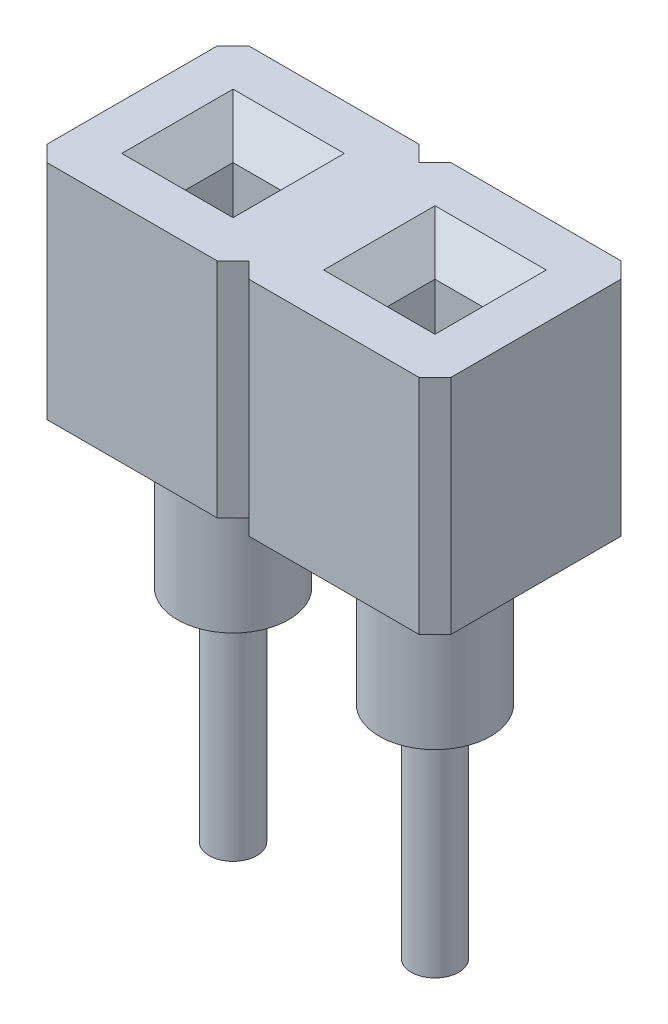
ISO-10303-21;
HEADER;
FILE_DESCRIPTION(('STEP AP214'),'2;1');
FILE_NAME('part.step','',(''),(''),'','','');
FILE_SCHEMA(('AUTOMOTIVE_DESIGN { 1 0 10303 214 1 1 1 1 }'));
ENDSEC;
DATA;
#1=APPLICATION_CONTEXT('core data for automotive mechanical design processes');
#2=APPLICATION_PROTOCOL_DEFINITION('international standard','automotive_design',2000,#1);
#3=PRODUCT_CONTEXT('',#1,'mechanical');
#4=PRODUCT('Part','Part','',(#3));
#5=PRODUCT_RELATED_PRODUCT_CATEGORY('part','',(#4));
#6=PRODUCT_DEFINITION_FORMATION('','',#4);
#7=PRODUCT_DEFINITION_CONTEXT('part definition',#1,'design');
#8=PRODUCT_DEFINITION('design','',#6,#7);
#9=PRODUCT_DEFINITION_SHAPE('','',#8);
#10=(LENGTH_UNIT() NAMED_UNIT(*) SI_UNIT(.MILLI.,.METRE.));
#11=(NAMED_UNIT(*) PLANE_ANGLE_UNIT() SI_UNIT($,.RADIAN.));
#12=(NAMED_UNIT(*) SI_UNIT($,.STERADIAN.) SOLID_ANGLE_UNIT());
#13=UNCERTAINTY_MEASURE_WITH_UNIT(LENGTH_MEASURE(1.E-05),#10,'distance_accuracy_value','');
#14=(GEOMETRIC_REPRESENTATION_CONTEXT(3) GLOBAL_UNCERTAINTY_ASSIGNED_CONTEXT((#13)) GLOBAL_UNIT_ASSIGNED_CONTEXT((#10,
#11,#12)) REPRESENTATION_CONTEXT('',''));
#15=CARTESIAN_POINT('',(0.,0.,0.));
#16=DIRECTION('',(0.,0.,1.));
#17=DIRECTION('',(1.,0.,0.));
#18=AXIS2_PLACEMENT_3D('',#15,#16,#17);
#19=CARTESIAN_POINT('',(2.34,0.,0.));
#20=DIRECTION('',(0.,-1.,0.));
#21=DIRECTION('',(0.,0.,-1.));
#22=AXIS2_PLACEMENT_3D('',#19,#20,#21);
#23=PLANE('',#22);
#24=CARTESIAN_POINT('',(0.,0.,0.));
#25=DIRECTION('',(0.,1.,0.));
#26=DIRECTION('',(-1.,0.,0.));
#27=AXIS2_PLACEMENT_3D('',#24,#25,#26);
#28=CIRCLE('',#27,0.7);
#29=CARTESIAN_POINT('',(-0.7,0.,0.));
#30=VERTEX_POINT('',#29);
#31=EDGE_CURVE('E293',#30,#30,#28,.T.);
#32=ORIENTED_EDGE('',*,*,#31,.T.);
#33=EDGE_LOOP('',(#32));
#34=FACE_BOUND('',#33,.T.);
#35=DIRECTION('',(-0.707106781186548,0.,-0.707106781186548));
#36=VECTOR('',#35,1.);
#37=CARTESIAN_POINT('',(1.07,0.,-1.27));
#38=LINE('',#37,#36);
#39=CARTESIAN_POINT('',(1.27,0.,-1.07));
#40=VERTEX_POINT('',#39);
#41=CARTESIAN_POINT('',(1.07,0.,-1.27));
#42=VERTEX_POINT('',#41);
#43=EDGE_CURVE('E316',#40,#42,#38,.T.);
#44=ORIENTED_EDGE('',*,*,#43,.F.);
#45=DIRECTION('',(0.,0.,-1.));
#46=VECTOR('',#45,1.);
#47=CARTESIAN_POINT('',(1.27,0.,-1.07));
#48=LINE('',#47,#46);
#49=CARTESIAN_POINT('',(1.27,0.,1.07));
#50=VERTEX_POINT('',#49);
#51=EDGE_CURVE('E329',#50,#40,#48,.T.);
#52=ORIENTED_EDGE('',*,*,#51,.F.);
#53=DIRECTION('',(0.707106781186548,0.,-0.707106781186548));
#54=VECTOR('',#53,1.);
#55=CARTESIAN_POINT('',(1.27,0.,1.07));
#56=LINE('',#55,#54);
#57=CARTESIAN_POINT('',(1.07,0.,1.27));
#58=VERTEX_POINT('',#57);
#59=EDGE_CURVE('E327',#58,#50,#56,.T.);
#60=ORIENTED_EDGE('',*,*,#59,.F.);
#61=DIRECTION('',(1.,0.,0.));
#62=VECTOR('',#61,1.);
#63=CARTESIAN_POINT('',(-1.07,0.,1.27));
#64=LINE('',#63,#62);
#65=CARTESIAN_POINT('',(-1.07,0.,1.27));
#66=VERTEX_POINT('',#65);
#67=EDGE_CURVE('E325',#66,#58,#64,.T.);
#68=ORIENTED_EDGE('',*,*,#67,.F.);
#69=DIRECTION('',(0.707106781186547,0.,0.707106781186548));
#70=VECTOR('',#69,1.);
#71=CARTESIAN_POINT('',(-1.27,0.,1.07));
#72=LINE('',#71,#70);
#73=CARTESIAN_POINT('',(-1.27,0.,1.07));
#74=VERTEX_POINT('',#73);
#75=EDGE_CURVE('E323',#74,#66,#72,.T.);
#76=ORIENTED_EDGE('',*,*,#75,.F.);
#77=DIRECTION('',(0.707106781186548,0.,-0.707106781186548));
#78=VECTOR('',#77,1.);
#79=CARTESIAN_POINT('',(-1.27,0.,1.07));
#80=LINE('',#79,#78);
#81=CARTESIAN_POINT('',(-1.47,0.,1.27));
#82=VERTEX_POINT('',#81);
#83=EDGE_CURVE('E237',#82,#74,#80,.T.);
#84=ORIENTED_EDGE('',*,*,#83,.F.);
#85=DIRECTION('',(1.,0.,0.));
#86=VECTOR('',#85,1.);
#87=CARTESIAN_POINT('',(-3.61,0.,1.27));
#88=LINE('',#87,#86);
#89=CARTESIAN_POINT('',(-3.61,0.,1.27));
#90=VERTEX_POINT('',#89);
#91=EDGE_CURVE('E235',#90,#82,#88,.T.);
#92=ORIENTED_EDGE('',*,*,#91,.F.);
#93=DIRECTION('',(0.707106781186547,0.,0.707106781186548));
#94=VECTOR('',#93,1.);
#95=CARTESIAN_POINT('',(-3.81,0.,1.07));
#96=LINE('',#95,#94);
#97=CARTESIAN_POINT('',(-3.81,0.,1.07));
#98=VERTEX_POINT('',#97);
#99=EDGE_CURVE('E233',#98,#90,#96,.T.);
#100=ORIENTED_EDGE('',*,*,#99,.F.);
#101=DIRECTION('',(0.,0.,1.));
#102=VECTOR('',#101,1.);
#103=CARTESIAN_POINT('',(-3.81,0.,-1.07));
#104=LINE('',#103,#102);
#105=CARTESIAN_POINT('',(-3.81,0.,-1.07));
#106=VERTEX_POINT('',#105);
#107=EDGE_CURVE('E231',#106,#98,#104,.T.);
#108=ORIENTED_EDGE('',*,*,#107,.F.);
#109=DIRECTION('',(-0.707106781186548,0.,0.707106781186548));
#110=VECTOR('',#109,1.);
#111=CARTESIAN_POINT('',(-3.61,0.,-1.27));
#112=LINE('',#111,#110);
#113=CARTESIAN_POINT('',(-3.61,0.,-1.27));
#114=VERTEX_POINT('',#113);
#115=EDGE_CURVE('E229',#114,#106,#112,.T.);
#116=ORIENTED_EDGE('',*,*,#115,.F.);
#117=DIRECTION('',(-1.,0.,0.));
#118=VECTOR('',#117,1.);
#119=CARTESIAN_POINT('',(-3.61,0.,-1.27));
#120=LINE('',#119,#118);
#121=CARTESIAN_POINT('',(-1.47,0.,-1.27));
#122=VERTEX_POINT('',#121);
#123=EDGE_CURVE('E227',#122,#114,#120,.T.);
#124=ORIENTED_EDGE('',*,*,#123,.F.);
#125=DIRECTION('',(-0.707106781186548,0.,-0.707106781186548));
#126=VECTOR('',#125,1.);
#127=CARTESIAN_POINT('',(-1.47,0.,-1.27));
#128=LINE('',#127,#126);
#129=CARTESIAN_POINT('',(-1.27,0.,-1.07));
#130=VERTEX_POINT('',#129);
#131=EDGE_CURVE('E224',#130,#122,#128,.T.);
#132=ORIENTED_EDGE('',*,*,#131,.F.);
#133=DIRECTION('',(-0.707106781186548,0.,0.707106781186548));
#134=VECTOR('',#133,1.);
#135=CARTESIAN_POINT('',(-1.07,0.,-1.27));
#136=LINE('',#135,#134);
#137=CARTESIAN_POINT('',(-1.07,0.,-1.27));
#138=VERTEX_POINT('',#137);
#139=EDGE_CURVE('E321',#138,#130,#136,.T.);
#140=ORIENTED_EDGE('',*,*,#139,.F.);
#141=DIRECTION('',(-1.,0.,0.));
#142=VECTOR('',#141,1.);
#143=CARTESIAN_POINT('',(-1.07,0.,-1.27));
#144=LINE('',#143,#142);
#145=EDGE_CURVE('E319',#42,#138,#144,.T.);
#146=ORIENTED_EDGE('',*,*,#145,.F.);
#147=EDGE_LOOP('',(#44,#52,#60,#68,#76,#84,#92,#100,#108,#116,#124,#132,#140,#146));
#148=FACE_BOUND('',#147,.T.);
#149=CARTESIAN_POINT('',(-2.54,0.,0.));
#150=DIRECTION('',(0.,1.,0.));
#151=DIRECTION('',(-1.,0.,0.));
#152=AXIS2_PLACEMENT_3D('',#149,#150,#151);
#153=CIRCLE('',#152,0.7);
#154=CARTESIAN_POINT('',(-3.24,0.,0.));
#155=VERTEX_POINT('',#154);
#156=EDGE_CURVE('E211',#155,#155,#153,.T.);
#157=ORIENTED_EDGE('',*,*,#156,.T.);
#158=EDGE_LOOP('',(#157));
#159=FACE_BOUND('',#158,.T.);
#160=ADVANCED_FACE('F26',(#34,#148,#159),#23,.T.);
#161=CARTESIAN_POINT('',(2.34,2.8,0.));
#162=DIRECTION('',(0.,-1.,0.));
#163=DIRECTION('',(0.,0.,-1.));
#164=AXIS2_PLACEMENT_3D('',#161,#162,#163);
#165=PLANE('',#164);
#166=DIRECTION('',(1.,0.,0.));
#167=VECTOR('',#166,1.);
#168=CARTESIAN_POINT('',(-2.24,2.8,-0.700000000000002));
#169=LINE('',#168,#167);
#170=CARTESIAN_POINT('',(-3.24,2.8,-0.700000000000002));
#171=VERTEX_POINT('',#170);
#172=CARTESIAN_POINT('',(-1.84,2.8,-0.700000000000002));
#173=VERTEX_POINT('',#172);
#174=EDGE_CURVE('E390',#171,#173,#169,.T.);
#175=ORIENTED_EDGE('',*,*,#174,.T.);
#176=DIRECTION('',(0.,0.,1.));
#177=VECTOR('',#176,1.);
#178=CARTESIAN_POINT('',(-1.84,2.8,0.3));
#179=LINE('',#178,#177);
#180=CARTESIAN_POINT('',(-1.84,2.8,0.700000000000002));
#181=VERTEX_POINT('',#180);
#182=EDGE_CURVE('E396',#173,#181,#179,.T.);
#183=ORIENTED_EDGE('',*,*,#182,.T.);
#184=DIRECTION('',(-1.,0.,0.));
#185=VECTOR('',#184,1.);
#186=CARTESIAN_POINT('',(-2.84,2.8,0.700000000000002));
#187=LINE('',#186,#185);
#188=CARTESIAN_POINT('',(-3.24,2.8,0.700000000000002));
#189=VERTEX_POINT('',#188);
#190=EDGE_CURVE('E394',#181,#189,#187,.T.);
#191=ORIENTED_EDGE('',*,*,#190,.T.);
#192=DIRECTION('',(0.,0.,-1.));
#193=VECTOR('',#192,1.);
#194=CARTESIAN_POINT('',(-3.24,2.8,-0.3));
#195=LINE('',#194,#193);
#196=EDGE_CURVE('E392',#189,#171,#195,.T.);
#197=ORIENTED_EDGE('',*,*,#196,.T.);
#198=EDGE_LOOP('',(#175,#183,#191,#197));
#199=FACE_BOUND('',#198,.T.);
#200=DIRECTION('',(1.,0.,0.));
#201=VECTOR('',#200,1.);
#202=CARTESIAN_POINT('',(0.299999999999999,2.8,-0.700000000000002));
#203=LINE('',#202,#201);
#204=CARTESIAN_POINT('',(-0.700000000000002,2.8,-0.700000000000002));
#205=VERTEX_POINT('',#204);
#206=CARTESIAN_POINT('',(0.700000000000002,2.8,-0.700000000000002));
#207=VERTEX_POINT('',#206);
#208=EDGE_CURVE('E372',#205,#207,#203,.T.);
#209=ORIENTED_EDGE('',*,*,#208,.T.);
#210=DIRECTION('',(0.,0.,1.));
#211=VECTOR('',#210,1.);
#212=CARTESIAN_POINT('',(0.700000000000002,2.8,0.3));
#213=LINE('',#212,#211);
#214=CARTESIAN_POINT('',(0.700000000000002,2.8,0.700000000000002));
#215=VERTEX_POINT('',#214);
#216=EDGE_CURVE('E378',#207,#215,#213,.T.);
#217=ORIENTED_EDGE('',*,*,#216,.T.);
#218=DIRECTION('',(-1.,0.,0.));
#219=VECTOR('',#218,1.);
#220=CARTESIAN_POINT('',(-0.3,2.8,0.700000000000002));
#221=LINE('',#220,#219);
#222=CARTESIAN_POINT('',(-0.700000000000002,2.8,0.700000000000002));
#223=VERTEX_POINT('',#222);
#224=EDGE_CURVE('E376',#215,#223,#221,.T.);
#225=ORIENTED_EDGE('',*,*,#224,.T.);
#226=DIRECTION('',(0.,0.,-1.));
#227=VECTOR('',#226,1.);
#228=CARTESIAN_POINT('',(-0.700000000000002,2.8,-0.3));
#229=LINE('',#228,#227);
#230=EDGE_CURVE('E374',#223,#205,#229,.T.);
#231=ORIENTED_EDGE('',*,*,#230,.T.);
#232=EDGE_LOOP('',(#209,#217,#225,#231));
#233=FACE_BOUND('',#232,.T.);
#234=DIRECTION('',(-0.707106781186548,0.,-0.707106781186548));
#235=VECTOR('',#234,1.);
#236=CARTESIAN_POINT('',(1.07,2.8,-1.27));
#237=LINE('',#236,#235);
#238=CARTESIAN_POINT('',(1.27,2.8,-1.07));
#239=VERTEX_POINT('',#238);
#240=CARTESIAN_POINT('',(1.07,2.8,-1.27));
#241=VERTEX_POINT('',#240);
#242=EDGE_CURVE('E331',#239,#241,#237,.T.);
#243=ORIENTED_EDGE('',*,*,#242,.T.);
#244=DIRECTION('',(-1.,0.,0.));
#245=VECTOR('',#244,1.);
#246=CARTESIAN_POINT('',(-1.07,2.8,-1.27));
#247=LINE('',#246,#245);
#248=CARTESIAN_POINT('',(-1.07,2.8,-1.27));
#249=VERTEX_POINT('',#248);
#250=EDGE_CURVE('E334',#241,#249,#247,.T.);
#251=ORIENTED_EDGE('',*,*,#250,.T.);
#252=DIRECTION('',(-0.707106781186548,0.,0.707106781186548));
#253=VECTOR('',#252,1.);
#254=CARTESIAN_POINT('',(-1.07,2.8,-1.27));
#255=LINE('',#254,#253);
#256=CARTESIAN_POINT('',(-1.27,2.8,-1.07));
#257=VERTEX_POINT('',#256);
#258=EDGE_CURVE('E336',#249,#257,#255,.T.);
#259=ORIENTED_EDGE('',*,*,#258,.T.);
#260=DIRECTION('',(-0.707106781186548,0.,-0.707106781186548));
#261=VECTOR('',#260,1.);
#262=CARTESIAN_POINT('',(-1.47,2.8,-1.27));
#263=LINE('',#262,#261);
#264=CARTESIAN_POINT('',(-1.47,2.8,-1.27));
#265=VERTEX_POINT('',#264);
#266=EDGE_CURVE('E240',#257,#265,#263,.T.);
#267=ORIENTED_EDGE('',*,*,#266,.T.);
#268=DIRECTION('',(-1.,0.,0.));
#269=VECTOR('',#268,1.);
#270=CARTESIAN_POINT('',(-3.61,2.8,-1.27));
#271=LINE('',#270,#269);
#272=CARTESIAN_POINT('',(-3.61,2.8,-1.27));
#273=VERTEX_POINT('',#272);
#274=EDGE_CURVE('E243',#265,#273,#271,.T.);
#275=ORIENTED_EDGE('',*,*,#274,.T.);
#276=DIRECTION('',(-0.707106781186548,0.,0.707106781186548));
#277=VECTOR('',#276,1.);
#278=CARTESIAN_POINT('',(-3.61,2.8,-1.27));
#279=LINE('',#278,#277);
#280=CARTESIAN_POINT('',(-3.81,2.8,-1.07));
#281=VERTEX_POINT('',#280);
#282=EDGE_CURVE('E245',#273,#281,#279,.T.);
#283=ORIENTED_EDGE('',*,*,#282,.T.);
#284=DIRECTION('',(0.,0.,1.));
#285=VECTOR('',#284,1.);
#286=CARTESIAN_POINT('',(-3.81,2.8,-1.07));
#287=LINE('',#286,#285);
#288=CARTESIAN_POINT('',(-3.81,2.8,1.07));
#289=VERTEX_POINT('',#288);
#290=EDGE_CURVE('E247',#281,#289,#287,.T.);
#291=ORIENTED_EDGE('',*,*,#290,.T.);
#292=DIRECTION('',(0.707106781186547,0.,0.707106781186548));
#293=VECTOR('',#292,1.);
#294=CARTESIAN_POINT('',(-3.81,2.8,1.07));
#295=LINE('',#294,#293);
#296=CARTESIAN_POINT('',(-3.61,2.8,1.27));
#297=VERTEX_POINT('',#296);
#298=EDGE_CURVE('E249',#289,#297,#295,.T.);
#299=ORIENTED_EDGE('',*,*,#298,.T.);
#300=DIRECTION('',(1.,0.,0.));
#301=VECTOR('',#300,1.);
#302=CARTESIAN_POINT('',(-3.61,2.8,1.27));
#303=LINE('',#302,#301);
#304=CARTESIAN_POINT('',(-1.47,2.8,1.27));
#305=VERTEX_POINT('',#304);
#306=EDGE_CURVE('E251',#297,#305,#303,.T.);
#307=ORIENTED_EDGE('',*,*,#306,.T.);
#308=DIRECTION('',(0.707106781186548,0.,-0.707106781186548));
#309=VECTOR('',#308,1.);
#310=CARTESIAN_POINT('',(-1.27,2.8,1.07));
#311=LINE('',#310,#309);
#312=CARTESIAN_POINT('',(-1.27,2.8,1.07));
#313=VERTEX_POINT('',#312);
#314=EDGE_CURVE('E253',#305,#313,#311,.T.);
#315=ORIENTED_EDGE('',*,*,#314,.T.);
#316=DIRECTION('',(0.707106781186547,0.,0.707106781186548));
#317=VECTOR('',#316,1.);
#318=CARTESIAN_POINT('',(-1.27,2.8,1.07));
#319=LINE('',#318,#317);
#320=CARTESIAN_POINT('',(-1.07,2.8,1.27));
#321=VERTEX_POINT('',#320);
#322=EDGE_CURVE('E338',#313,#321,#319,.T.);
#323=ORIENTED_EDGE('',*,*,#322,.T.);
#324=DIRECTION('',(1.,0.,0.));
#325=VECTOR('',#324,1.);
#326=CARTESIAN_POINT('',(-1.07,2.8,1.27));
#327=LINE('',#326,#325);
#328=CARTESIAN_POINT('',(1.07,2.8,1.27));
#329=VERTEX_POINT('',#328);
#330=EDGE_CURVE('E340',#321,#329,#327,.T.);
#331=ORIENTED_EDGE('',*,*,#330,.T.);
#332=DIRECTION('',(0.707106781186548,0.,-0.707106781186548));
#333=VECTOR('',#332,1.);
#334=CARTESIAN_POINT('',(1.27,2.8,1.07));
#335=LINE('',#334,#333);
#336=CARTESIAN_POINT('',(1.27,2.8,1.07));
#337=VERTEX_POINT('',#336);
#338=EDGE_CURVE('E342',#329,#337,#335,.T.);
#339=ORIENTED_EDGE('',*,*,#338,.T.);
#340=DIRECTION('',(0.,0.,-1.));
#341=VECTOR('',#340,1.);
#342=CARTESIAN_POINT('',(1.27,2.8,-1.07));
#343=LINE('',#342,#341);
#344=EDGE_CURVE('E344',#337,#239,#343,.T.);
#345=ORIENTED_EDGE('',*,*,#344,.T.);
#346=EDGE_LOOP('',(#243,#251,#259,#267,#275,#283,#291,#299,#307,#315,#323,#331,#339,#345));
#347=FACE_BOUND('',#346,.T.);
#348=ADVANCED_FACE('F473',(#199,#233,#347),#165,.F.);
#349=CARTESIAN_POINT('',(1.07,2.8,-1.27));
#350=DIRECTION('',(-0.707106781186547,0.,0.707106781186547));
#351=DIRECTION('',(0.707106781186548,0.,0.707106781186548));
#352=AXIS2_PLACEMENT_3D('',#349,#350,#351);
#353=PLANE('',#352);
#354=ORIENTED_EDGE('',*,*,#43,.T.);
#355=DIRECTION('',(0.,-1.,0.));
#356=VECTOR('',#355,1.);
#357=CARTESIAN_POINT('',(1.07,2.8,-1.27));
#358=LINE('',#357,#356);
#359=EDGE_CURVE('E366',#241,#42,#358,.T.);
#360=ORIENTED_EDGE('',*,*,#359,.F.);
#361=ORIENTED_EDGE('',*,*,#242,.F.);
#362=DIRECTION('',(0.,-1.,0.));
#363=VECTOR('',#362,1.);
#364=CARTESIAN_POINT('',(1.27,2.8,-1.07));
#365=LINE('',#364,#363);
#366=EDGE_CURVE('E346',#239,#40,#365,.T.);
#367=ORIENTED_EDGE('',*,*,#366,.T.);
#368=EDGE_LOOP('',(#354,#360,#361,#367));
#369=FACE_BOUND('',#368,.T.);
#370=ADVANCED_FACE('F28',(#369),#353,.F.);
#371=CARTESIAN_POINT('',(-1.07,2.8,-1.27));
#372=DIRECTION('',(0.,0.,1.));
#373=DIRECTION('',(1.,0.,0.));
#374=AXIS2_PLACEMENT_3D('',#371,#372,#373);
#375=PLANE('',#374);
#376=ORIENTED_EDGE('',*,*,#145,.T.);
#377=DIRECTION('',(0.,-1.,0.));
#378=VECTOR('',#377,1.);
#379=CARTESIAN_POINT('',(-1.07,2.8,-1.27));
#380=LINE('',#379,#378);
#381=EDGE_CURVE('E363',#249,#138,#380,.T.);
#382=ORIENTED_EDGE('',*,*,#381,.F.);
#383=ORIENTED_EDGE('',*,*,#250,.F.);
#384=ORIENTED_EDGE('',*,*,#359,.T.);
#385=EDGE_LOOP('',(#376,#382,#383,#384));
#386=FACE_BOUND('',#385,.T.);
#387=ADVANCED_FACE('F505',(#386),#375,.F.);
#388=CARTESIAN_POINT('',(-1.07,2.8,-1.27));
#389=DIRECTION('',(0.707106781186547,0.,0.707106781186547));
#390=DIRECTION('',(0.707106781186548,0.,-0.707106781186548));
#391=AXIS2_PLACEMENT_3D('',#388,#389,#390);
#392=PLANE('',#391);
#393=ORIENTED_EDGE('',*,*,#139,.T.);
#394=DIRECTION('',(0.,-1.,0.));
#395=VECTOR('',#394,1.);
#396=CARTESIAN_POINT('',(-1.27,2.8,-1.07));
#397=LINE('',#396,#395);
#398=EDGE_CURVE('E360',#257,#130,#397,.T.);
#399=ORIENTED_EDGE('',*,*,#398,.F.);
#400=ORIENTED_EDGE('',*,*,#258,.F.);
#401=ORIENTED_EDGE('',*,*,#381,.T.);
#402=EDGE_LOOP('',(#393,#399,#400,#401));
#403=FACE_BOUND('',#402,.T.);
#404=ADVANCED_FACE('F502',(#403),#392,.F.);
#405=CARTESIAN_POINT('',(-1.27,2.8,1.07));
#406=DIRECTION('',(0.707106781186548,0.,-0.707106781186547));
#407=DIRECTION('',(-0.707106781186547,0.,-0.707106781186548));
#408=AXIS2_PLACEMENT_3D('',#405,#406,#407);
#409=PLANE('',#408);
#410=ORIENTED_EDGE('',*,*,#75,.T.);
#411=DIRECTION('',(0.,-1.,0.));
#412=VECTOR('',#411,1.);
#413=CARTESIAN_POINT('',(-1.07,2.8,1.27));
#414=LINE('',#413,#412);
#415=EDGE_CURVE('E355',#321,#66,#414,.T.);
#416=ORIENTED_EDGE('',*,*,#415,.F.);
#417=ORIENTED_EDGE('',*,*,#322,.F.);
#418=DIRECTION('',(0.,-1.,0.));
#419=VECTOR('',#418,1.);
#420=CARTESIAN_POINT('',(-1.27,2.8,1.07));
#421=LINE('',#420,#419);
#422=EDGE_CURVE('E358',#313,#74,#421,.T.);
#423=ORIENTED_EDGE('',*,*,#422,.T.);
#424=EDGE_LOOP('',(#410,#416,#417,#423));
#425=FACE_BOUND('',#424,.T.);
#426=ADVANCED_FACE('F498',(#425),#409,.F.);
#427=CARTESIAN_POINT('',(-1.07,2.8,1.27));
#428=DIRECTION('',(0.,0.,-1.));
#429=DIRECTION('',(-1.,0.,0.));
#430=AXIS2_PLACEMENT_3D('',#427,#428,#429);
#431=PLANE('',#430);
#432=ORIENTED_EDGE('',*,*,#67,.T.);
#433=DIRECTION('',(0.,-1.,0.));
#434=VECTOR('',#433,1.);
#435=CARTESIAN_POINT('',(1.07,2.8,1.27));
#436=LINE('',#435,#434);
#437=EDGE_CURVE('E352',#329,#58,#436,.T.);
#438=ORIENTED_EDGE('',*,*,#437,.F.);
#439=ORIENTED_EDGE('',*,*,#330,.F.);
#440=ORIENTED_EDGE('',*,*,#415,.T.);
#441=EDGE_LOOP('',(#432,#438,#439,#440));
#442=FACE_BOUND('',#441,.T.);
#443=ADVANCED_FACE('F494',(#442),#431,.F.);
#444=CARTESIAN_POINT('',(1.27,2.8,1.07));
#445=DIRECTION('',(-0.707106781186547,0.,-0.707106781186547));
#446=DIRECTION('',(-0.707106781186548,0.,0.707106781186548));
#447=AXIS2_PLACEMENT_3D('',#444,#445,#446);
#448=PLANE('',#447);
#449=ORIENTED_EDGE('',*,*,#59,.T.);
#450=DIRECTION('',(0.,-1.,0.));
#451=VECTOR('',#450,1.);
#452=CARTESIAN_POINT('',(1.27,2.8,1.07));
#453=LINE('',#452,#451);
#454=EDGE_CURVE('E349',#337,#50,#453,.T.);
#455=ORIENTED_EDGE('',*,*,#454,.F.);
#456=ORIENTED_EDGE('',*,*,#338,.F.);
#457=ORIENTED_EDGE('',*,*,#437,.T.);
#458=EDGE_LOOP('',(#449,#455,#456,#457));
#459=FACE_BOUND('',#458,.T.);
#460=ADVANCED_FACE('F490',(#459),#448,.F.);
#461=CARTESIAN_POINT('',(1.27,2.8,-1.07));
#462=DIRECTION('',(-1.,0.,0.));
#463=DIRECTION('',(0.,0.,1.));
#464=AXIS2_PLACEMENT_3D('',#461,#462,#463);
#465=PLANE('',#464);
#466=ORIENTED_EDGE('',*,*,#51,.T.);
#467=ORIENTED_EDGE('',*,*,#366,.F.);
#468=ORIENTED_EDGE('',*,*,#344,.F.);
#469=ORIENTED_EDGE('',*,*,#454,.T.);
#470=EDGE_LOOP('',(#466,#467,#468,#469));
#471=FACE_BOUND('',#470,.T.);
#472=ADVANCED_FACE('F487',(#471),#465,.F.);
#473=CARTESIAN_POINT('',(-0.3,2.8,-0.3));
#474=DIRECTION('',(1.,0.,0.));
#475=DIRECTION('',(0.,0.,-1.));
#476=AXIS2_PLACEMENT_3D('',#473,#474,#475);
#477=PLANE('',#476);
#478=DIRECTION('',(0.,-1.,0.));
#479=VECTOR('',#478,1.);
#480=CARTESIAN_POINT('',(-0.3,2.8,-0.3));
#481=LINE('',#480,#479);
#482=CARTESIAN_POINT('',(-0.3,2.4,-0.3));
#483=VERTEX_POINT('',#482);
#484=CARTESIAN_POINT('',(-0.3,0.,-0.3));
#485=VERTEX_POINT('',#484);
#486=EDGE_CURVE('E308',#483,#485,#481,.T.);
#487=ORIENTED_EDGE('',*,*,#486,.F.);
#488=DIRECTION('',(0.,0.,1.));
#489=VECTOR('',#488,1.);
#490=CARTESIAN_POINT('',(-0.3,2.4,0.3));
#491=LINE('',#490,#489);
#492=CARTESIAN_POINT('',(-0.3,2.4,0.3));
#493=VERTEX_POINT('',#492);
#494=EDGE_CURVE('E383',#483,#493,#491,.T.);
#495=ORIENTED_EDGE('',*,*,#494,.T.);
#496=DIRECTION('',(0.,-1.,0.));
#497=VECTOR('',#496,1.);
#498=CARTESIAN_POINT('',(-0.3,2.8,0.3));
#499=LINE('',#498,#497);
#500=CARTESIAN_POINT('',(-0.3,0.,0.3));
#501=VERTEX_POINT('',#500);
#502=EDGE_CURVE('E314',#493,#501,#499,.T.);
#503=ORIENTED_EDGE('',*,*,#502,.T.);
#504=DIRECTION('',(0.,0.,1.));
#505=VECTOR('',#504,1.);
#506=CARTESIAN_POINT('',(-0.3,0.,-0.3));
#507=LINE('',#506,#505);
#508=EDGE_CURVE('E296',#485,#501,#507,.T.);
#509=ORIENTED_EDGE('',*,*,#508,.F.);
#510=EDGE_LOOP('',(#487,#495,#503,#509));
#511=FACE_BOUND('',#510,.T.);
#512=ADVANCED_FACE('F484',(#511),#477,.T.);
#513=CARTESIAN_POINT('',(-0.3,2.8,0.3));
#514=DIRECTION('',(0.,0.,-1.));
#515=DIRECTION('',(-1.,0.,0.));
#516=AXIS2_PLACEMENT_3D('',#513,#514,#515);
#517=PLANE('',#516);
#518=ORIENTED_EDGE('',*,*,#502,.F.);
#519=DIRECTION('',(1.,0.,0.));
#520=VECTOR('',#519,1.);
#521=CARTESIAN_POINT('',(0.3,2.4,0.3));
#522=LINE('',#521,#520);
#523=CARTESIAN_POINT('',(0.3,2.4,0.3));
#524=VERTEX_POINT('',#523);
#525=EDGE_CURVE('E381',#493,#524,#522,.T.);
#526=ORIENTED_EDGE('',*,*,#525,.T.);
#527=DIRECTION('',(0.,-1.,0.));
#528=VECTOR('',#527,1.);
#529=CARTESIAN_POINT('',(0.3,2.8,0.3));
#530=LINE('',#529,#528);
#531=CARTESIAN_POINT('',(0.3,0.,0.3));
#532=VERTEX_POINT('',#531);
#533=EDGE_CURVE('E312',#524,#532,#530,.T.);
#534=ORIENTED_EDGE('',*,*,#533,.T.);
#535=DIRECTION('',(1.,0.,0.));
#536=VECTOR('',#535,1.);
#537=CARTESIAN_POINT('',(-0.3,0.,0.3));
#538=LINE('',#537,#536);
#539=EDGE_CURVE('E299',#501,#532,#538,.T.);
#540=ORIENTED_EDGE('',*,*,#539,.F.);
#541=EDGE_LOOP('',(#518,#526,#534,#540));
#542=FACE_BOUND('',#541,.T.);
#543=ADVANCED_FACE('F616',(#542),#517,.T.);
#544=CARTESIAN_POINT('',(0.3,2.8,-0.3));
#545=DIRECTION('',(-1.,0.,0.));
#546=DIRECTION('',(0.,0.,1.));
#547=AXIS2_PLACEMENT_3D('',#544,#545,#546);
#548=PLANE('',#547);
#549=ORIENTED_EDGE('',*,*,#533,.F.);
#550=DIRECTION('',(0.,0.,-1.));
#551=VECTOR('',#550,1.);
#552=CARTESIAN_POINT('',(0.3,2.4,-0.3));
#553=LINE('',#552,#551);
#554=CARTESIAN_POINT('',(0.3,2.4,-0.3));
#555=VERTEX_POINT('',#554);
#556=EDGE_CURVE('E369',#524,#555,#553,.T.);
#557=ORIENTED_EDGE('',*,*,#556,.T.);
#558=DIRECTION('',(0.,-1.,0.));
#559=VECTOR('',#558,1.);
#560=CARTESIAN_POINT('',(0.3,2.8,-0.3));
#561=LINE('',#560,#559);
#562=CARTESIAN_POINT('',(0.3,0.,-0.3));
#563=VERTEX_POINT('',#562);
#564=EDGE_CURVE('E310',#555,#563,#561,.T.);
#565=ORIENTED_EDGE('',*,*,#564,.T.);
#566=DIRECTION('',(0.,0.,-1.));
#567=VECTOR('',#566,1.);
#568=CARTESIAN_POINT('',(0.3,0.,-0.3));
#569=LINE('',#568,#567);
#570=EDGE_CURVE('E302',#532,#563,#569,.T.);
#571=ORIENTED_EDGE('',*,*,#570,.F.);
#572=EDGE_LOOP('',(#549,#557,#565,#571));
#573=FACE_BOUND('',#572,.T.);
#574=ADVANCED_FACE('F613',(#573),#548,.T.);
#575=CARTESIAN_POINT('',(-0.3,2.8,-0.3));
#576=DIRECTION('',(0.,0.,1.));
#577=DIRECTION('',(1.,0.,0.));
#578=AXIS2_PLACEMENT_3D('',#575,#576,#577);
#579=PLANE('',#578);
#580=ORIENTED_EDGE('',*,*,#564,.F.);
#581=DIRECTION('',(-1.,0.,0.));
#582=VECTOR('',#581,1.);
#583=CARTESIAN_POINT('',(-0.3,2.4,-0.3));
#584=LINE('',#583,#582);
#585=EDGE_CURVE('E385',#555,#483,#584,.T.);
#586=ORIENTED_EDGE('',*,*,#585,.T.);
#587=ORIENTED_EDGE('',*,*,#486,.T.);
#588=DIRECTION('',(-1.,0.,0.));
#589=VECTOR('',#588,1.);
#590=CARTESIAN_POINT('',(-0.3,0.,-0.3));
#591=LINE('',#590,#589);
#592=EDGE_CURVE('E305',#563,#485,#591,.T.);
#593=ORIENTED_EDGE('',*,*,#592,.F.);
#594=EDGE_LOOP('',(#580,#586,#587,#593));
#595=FACE_BOUND('',#594,.T.);
#596=ADVANCED_FACE('F609',(#595),#579,.T.);
#597=CARTESIAN_POINT('',(0.7,0.,0.));
#598=DIRECTION('',(0.,-1.,0.));
#599=DIRECTION('',(1.,0.,0.));
#600=AXIS2_PLACEMENT_3D('',#597,#598,#599);
#601=PLANE('',#600);
#602=ORIENTED_EDGE('',*,*,#508,.T.);
#603=ORIENTED_EDGE('',*,*,#539,.T.);
#604=ORIENTED_EDGE('',*,*,#570,.T.);
#605=ORIENTED_EDGE('',*,*,#592,.T.);
#606=EDGE_LOOP('',(#602,#603,#604,#605));
#607=FACE_BOUND('',#606,.T.);
#608=ADVANCED_FACE('F605',(#607),#601,.F.);
#609=CARTESIAN_POINT('',(0.,0.,0.));
#610=DIRECTION('',(0.,1.,0.));
#611=DIRECTION('',(-1.,0.,0.));
#612=AXIS2_PLACEMENT_3D('',#609,#610,#611);
#613=CYLINDRICAL_SURFACE('',#612,0.7);
#614=ORIENTED_EDGE('',*,*,#31,.F.);
#615=EDGE_LOOP('',(#614));
#616=FACE_BOUND('',#615,.T.);
#617=CARTESIAN_POINT('',(0.,-1.93,0.));
#618=DIRECTION('',(0.,1.,0.));
#619=DIRECTION('',(-1.,0.,0.));
#620=AXIS2_PLACEMENT_3D('',#617,#618,#619);
#621=CIRCLE('',#620,0.7);
#622=CARTESIAN_POINT('',(-0.7,-1.93,0.));
#623=VERTEX_POINT('',#622);
#624=EDGE_CURVE('E290',#623,#623,#621,.T.);
#625=ORIENTED_EDGE('',*,*,#624,.T.);
#626=EDGE_LOOP('',(#625));
#627=FACE_BOUND('',#626,.T.);
#628=ADVANCED_FACE('F601',(#616,#627),#613,.T.);
#629=CARTESIAN_POINT('',(0.,-2.2,0.));
#630=DIRECTION('',(0.,1.,0.));
#631=DIRECTION('',(-1.,0.,0.));
#632=AXIS2_PLACEMENT_3D('',#629,#630,#631);
#633=CONICAL_SURFACE('',#632,0.3,0.977046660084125);
#634=ORIENTED_EDGE('',*,*,#624,.F.);
#635=EDGE_LOOP('',(#634));
#636=FACE_BOUND('',#635,.T.);
#637=CARTESIAN_POINT('',(0.,-2.2,0.));
#638=DIRECTION('',(0.,1.,0.));
#639=DIRECTION('',(-1.,0.,0.));
#640=AXIS2_PLACEMENT_3D('',#637,#638,#639);
#641=CIRCLE('',#640,0.3);
#642=CARTESIAN_POINT('',(-0.3,-2.2,0.));
#643=VERTEX_POINT('',#642);
#644=EDGE_CURVE('E287',#643,#643,#641,.T.);
#645=ORIENTED_EDGE('',*,*,#644,.T.);
#646=EDGE_LOOP('',(#645));
#647=FACE_BOUND('',#646,.T.);
#648=ADVANCED_FACE('F597',(#636,#647),#633,.T.);
#649=CARTESIAN_POINT('',(0.,0.,0.));
#650=DIRECTION('',(0.,1.,0.));
#651=DIRECTION('',(-1.,0.,0.));
#652=AXIS2_PLACEMENT_3D('',#649,#650,#651);
#653=CYLINDRICAL_SURFACE('',#652,0.3);
#654=ORIENTED_EDGE('',*,*,#644,.F.);
#655=EDGE_LOOP('',(#654));
#656=FACE_BOUND('',#655,.T.);
#657=CARTESIAN_POINT('',(0.,-4.7,0.));
#658=DIRECTION('',(0.,1.,0.));
#659=DIRECTION('',(-1.,0.,0.));
#660=AXIS2_PLACEMENT_3D('',#657,#658,#659);
#661=CIRCLE('',#660,0.3);
#662=CARTESIAN_POINT('',(-0.299999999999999,-4.7,0.));
#663=VERTEX_POINT('',#662);
#664=EDGE_CURVE('E284',#663,#663,#661,.T.);
#665=ORIENTED_EDGE('',*,*,#664,.T.);
#666=EDGE_LOOP('',(#665));
#667=FACE_BOUND('',#666,.T.);
#668=ADVANCED_FACE('F593',(#656,#667),#653,.T.);
#669=CARTESIAN_POINT('',(0.,-4.7,0.));
#670=DIRECTION('',(0.,1.,0.));
#671=DIRECTION('',(-1.,0.,0.));
#672=AXIS2_PLACEMENT_3D('',#669,#670,#671);
#673=PLANE('',#672);
#674=ORIENTED_EDGE('',*,*,#664,.F.);
#675=EDGE_LOOP('',(#674));
#676=FACE_BOUND('',#675,.T.);
#677=ADVANCED_FACE('F589',(#676),#673,.F.);
#678=CARTESIAN_POINT('',(-0.3,2.4,-0.3));
#679=DIRECTION('',(0.707106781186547,0.707106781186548,0.));
#680=DIRECTION('',(-0.707106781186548,0.707106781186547,0.));
#681=AXIS2_PLACEMENT_3D('',#678,#679,#680);
#682=PLANE('',#681);
#683=DIRECTION('',(0.577350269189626,-0.577350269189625,0.577350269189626));
#684=VECTOR('',#683,1.);
#685=CARTESIAN_POINT('',(-0.3,2.4,-0.3));
#686=LINE('',#685,#684);
#687=EDGE_CURVE('E278',#205,#483,#686,.T.);
#688=ORIENTED_EDGE('',*,*,#687,.F.);
#689=ORIENTED_EDGE('',*,*,#230,.F.);
#690=DIRECTION('',(0.577350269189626,-0.577350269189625,-0.577350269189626));
#691=VECTOR('',#690,1.);
#692=CARTESIAN_POINT('',(-0.3,2.4,0.3));
#693=LINE('',#692,#691);
#694=EDGE_CURVE('E281',#493,#223,#693,.F.);
#695=ORIENTED_EDGE('',*,*,#694,.F.);
#696=ORIENTED_EDGE('',*,*,#494,.F.);
#697=EDGE_LOOP('',(#688,#689,#695,#696));
#698=FACE_BOUND('',#697,.T.);
#699=ADVANCED_FACE('F585',(#698),#682,.T.);
#700=CARTESIAN_POINT('',(-0.3,2.4,0.3));
#701=DIRECTION('',(0.,0.707106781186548,-0.707106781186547));
#702=DIRECTION('',(0.,0.707106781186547,0.707106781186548));
#703=AXIS2_PLACEMENT_3D('',#700,#701,#702);
#704=PLANE('',#703);
#705=ORIENTED_EDGE('',*,*,#694,.T.);
#706=ORIENTED_EDGE('',*,*,#224,.F.);
#707=DIRECTION('',(-0.577350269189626,-0.577350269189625,-0.577350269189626));
#708=VECTOR('',#707,1.);
#709=CARTESIAN_POINT('',(0.0999999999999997,2.2,0.0999999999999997));
#710=LINE('',#709,#708);
#711=EDGE_CURVE('E276',#524,#215,#710,.F.);
#712=ORIENTED_EDGE('',*,*,#711,.F.);
#713=ORIENTED_EDGE('',*,*,#525,.F.);
#714=EDGE_LOOP('',(#705,#706,#712,#713));
#715=FACE_BOUND('',#714,.T.);
#716=ADVANCED_FACE('F581',(#715),#704,.T.);
#717=CARTESIAN_POINT('',(-0.3,2.4,-0.3));
#718=DIRECTION('',(0.,0.707106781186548,0.707106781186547));
#719=DIRECTION('',(0.,-0.707106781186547,0.707106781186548));
#720=AXIS2_PLACEMENT_3D('',#717,#718,#719);
#721=PLANE('',#720);
#722=ORIENTED_EDGE('',*,*,#687,.T.);
#723=ORIENTED_EDGE('',*,*,#585,.F.);
#724=DIRECTION('',(0.577350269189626,0.577350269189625,-0.577350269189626));
#725=VECTOR('',#724,1.);
#726=CARTESIAN_POINT('',(0.3,2.4,-0.3));
#727=LINE('',#726,#725);
#728=EDGE_CURVE('E274',#207,#555,#727,.F.);
#729=ORIENTED_EDGE('',*,*,#728,.F.);
#730=ORIENTED_EDGE('',*,*,#208,.F.);
#731=EDGE_LOOP('',(#722,#723,#729,#730));
#732=FACE_BOUND('',#731,.T.);
#733=ADVANCED_FACE('F577',(#732),#721,.T.);
#734=CARTESIAN_POINT('',(0.3,2.4,-0.3));
#735=DIRECTION('',(-0.707106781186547,0.707106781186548,0.));
#736=DIRECTION('',(-0.707106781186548,-0.707106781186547,0.));
#737=AXIS2_PLACEMENT_3D('',#734,#735,#736);
#738=PLANE('',#737);
#739=ORIENTED_EDGE('',*,*,#711,.T.);
#740=ORIENTED_EDGE('',*,*,#216,.F.);
#741=ORIENTED_EDGE('',*,*,#728,.T.);
#742=ORIENTED_EDGE('',*,*,#556,.F.);
#743=EDGE_LOOP('',(#739,#740,#741,#742));
#744=FACE_BOUND('',#743,.T.);
#745=ADVANCED_FACE('F572',(#744),#738,.T.);
#746=CARTESIAN_POINT('',(-1.47,2.8,-1.27));
#747=DIRECTION('',(-0.707106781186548,0.,0.707106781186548));
#748=DIRECTION('',(0.707106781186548,0.,0.707106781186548));
#749=AXIS2_PLACEMENT_3D('',#746,#747,#748);
#750=PLANE('',#749);
#751=ORIENTED_EDGE('',*,*,#131,.T.);
#752=DIRECTION('',(0.,-1.,0.));
#753=VECTOR('',#752,1.);
#754=CARTESIAN_POINT('',(-1.47,2.8,-1.27));
#755=LINE('',#754,#753);
#756=EDGE_CURVE('E271',#265,#122,#755,.T.);
#757=ORIENTED_EDGE('',*,*,#756,.F.);
#758=ORIENTED_EDGE('',*,*,#266,.F.);
#759=ORIENTED_EDGE('',*,*,#398,.T.);
#760=EDGE_LOOP('',(#751,#757,#758,#759));
#761=FACE_BOUND('',#760,.T.);
#762=ADVANCED_FACE('F523',(#761),#750,.F.);
#763=CARTESIAN_POINT('',(-3.61,2.8,-1.27));
#764=DIRECTION('',(0.,0.,1.));
#765=DIRECTION('',(1.,0.,0.));
#766=AXIS2_PLACEMENT_3D('',#763,#764,#765);
#767=PLANE('',#766);
#768=ORIENTED_EDGE('',*,*,#123,.T.);
#769=DIRECTION('',(0.,-1.,0.));
#770=VECTOR('',#769,1.);
#771=CARTESIAN_POINT('',(-3.61,2.8,-1.27));
#772=LINE('',#771,#770);
#773=EDGE_CURVE('E268',#273,#114,#772,.T.);
#774=ORIENTED_EDGE('',*,*,#773,.F.);
#775=ORIENTED_EDGE('',*,*,#274,.F.);
#776=ORIENTED_EDGE('',*,*,#756,.T.);
#777=EDGE_LOOP('',(#768,#774,#775,#776));
#778=FACE_BOUND('',#777,.T.);
#779=ADVANCED_FACE('F564',(#778),#767,.F.);
#780=CARTESIAN_POINT('',(-3.61,2.8,-1.27));
#781=DIRECTION('',(0.707106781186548,0.,0.707106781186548));
#782=DIRECTION('',(0.707106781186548,0.,-0.707106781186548));
#783=AXIS2_PLACEMENT_3D('',#780,#781,#782);
#784=PLANE('',#783);
#785=ORIENTED_EDGE('',*,*,#115,.T.);
#786=DIRECTION('',(0.,-1.,0.));
#787=VECTOR('',#786,1.);
#788=CARTESIAN_POINT('',(-3.81,2.8,-1.07));
#789=LINE('',#788,#787);
#790=EDGE_CURVE('E265',#281,#106,#789,.T.);
#791=ORIENTED_EDGE('',*,*,#790,.F.);
#792=ORIENTED_EDGE('',*,*,#282,.F.);
#793=ORIENTED_EDGE('',*,*,#773,.T.);
#794=EDGE_LOOP('',(#785,#791,#792,#793));
#795=FACE_BOUND('',#794,.T.);
#796=ADVANCED_FACE('F562',(#795),#784,.F.);
#797=CARTESIAN_POINT('',(-3.81,2.8,-1.07));
#798=DIRECTION('',(1.,0.,0.));
#799=DIRECTION('',(0.,0.,-1.));
#800=AXIS2_PLACEMENT_3D('',#797,#798,#799);
#801=PLANE('',#800);
#802=ORIENTED_EDGE('',*,*,#107,.T.);
#803=DIRECTION('',(0.,-1.,0.));
#804=VECTOR('',#803,1.);
#805=CARTESIAN_POINT('',(-3.81,2.8,1.07));
#806=LINE('',#805,#804);
#807=EDGE_CURVE('E262',#289,#98,#806,.T.);
#808=ORIENTED_EDGE('',*,*,#807,.F.);
#809=ORIENTED_EDGE('',*,*,#290,.F.);
#810=ORIENTED_EDGE('',*,*,#790,.T.);
#811=EDGE_LOOP('',(#802,#808,#809,#810));
#812=FACE_BOUND('',#811,.T.);
#813=ADVANCED_FACE('F558',(#812),#801,.F.);
#814=CARTESIAN_POINT('',(-3.81,2.8,1.07));
#815=DIRECTION('',(0.707106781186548,0.,-0.707106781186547));
#816=DIRECTION('',(-0.707106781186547,0.,-0.707106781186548));
#817=AXIS2_PLACEMENT_3D('',#814,#815,#816);
#818=PLANE('',#817);
#819=ORIENTED_EDGE('',*,*,#99,.T.);
#820=DIRECTION('',(0.,-1.,0.));
#821=VECTOR('',#820,1.);
#822=CARTESIAN_POINT('',(-3.61,2.8,1.27));
#823=LINE('',#822,#821);
#824=EDGE_CURVE('E259',#297,#90,#823,.T.);
#825=ORIENTED_EDGE('',*,*,#824,.F.);
#826=ORIENTED_EDGE('',*,*,#298,.F.);
#827=ORIENTED_EDGE('',*,*,#807,.T.);
#828=EDGE_LOOP('',(#819,#825,#826,#827));
#829=FACE_BOUND('',#828,.T.);
#830=ADVANCED_FACE('F553',(#829),#818,.F.);
#831=CARTESIAN_POINT('',(-3.61,2.8,1.27));
#832=DIRECTION('',(0.,0.,-1.));
#833=DIRECTION('',(-1.,0.,0.));
#834=AXIS2_PLACEMENT_3D('',#831,#832,#833);
#835=PLANE('',#834);
#836=ORIENTED_EDGE('',*,*,#91,.T.);
#837=DIRECTION('',(0.,-1.,0.));
#838=VECTOR('',#837,1.);
#839=CARTESIAN_POINT('',(-1.47,2.8,1.27));
#840=LINE('',#839,#838);
#841=EDGE_CURVE('E256',#305,#82,#840,.T.);
#842=ORIENTED_EDGE('',*,*,#841,.F.);
#843=ORIENTED_EDGE('',*,*,#306,.F.);
#844=ORIENTED_EDGE('',*,*,#824,.T.);
#845=EDGE_LOOP('',(#836,#842,#843,#844));
#846=FACE_BOUND('',#845,.T.);
#847=ADVANCED_FACE('F548',(#846),#835,.F.);
#848=CARTESIAN_POINT('',(-1.27,2.8,1.07));
#849=DIRECTION('',(-0.707106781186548,0.,-0.707106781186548));
#850=DIRECTION('',(-0.707106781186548,0.,0.707106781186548));
#851=AXIS2_PLACEMENT_3D('',#848,#849,#850);
#852=PLANE('',#851);
#853=ORIENTED_EDGE('',*,*,#83,.T.);
#854=ORIENTED_EDGE('',*,*,#422,.F.);
#855=ORIENTED_EDGE('',*,*,#314,.F.);
#856=ORIENTED_EDGE('',*,*,#841,.T.);
#857=EDGE_LOOP('',(#853,#854,#855,#856));
#858=FACE_BOUND('',#857,.T.);
#859=ADVANCED_FACE('F543',(#858),#852,.F.);
#860=CARTESIAN_POINT('',(-2.84,2.8,-0.3));
#861=DIRECTION('',(1.,0.,0.));
#862=DIRECTION('',(0.,0.,-1.));
#863=AXIS2_PLACEMENT_3D('',#860,#861,#862);
#864=PLANE('',#863);
#865=DIRECTION('',(0.,-1.,0.));
#866=VECTOR('',#865,1.);
#867=CARTESIAN_POINT('',(-2.84,2.8,-0.3));
#868=LINE('',#867,#866);
#869=CARTESIAN_POINT('',(-2.84,2.4,-0.3));
#870=VERTEX_POINT('',#869);
#871=CARTESIAN_POINT('',(-2.84,0.,-0.3));
#872=VERTEX_POINT('',#871);
#873=EDGE_CURVE('E195',#870,#872,#868,.T.);
#874=ORIENTED_EDGE('',*,*,#873,.F.);
#875=DIRECTION('',(0.,0.,1.));
#876=VECTOR('',#875,1.);
#877=CARTESIAN_POINT('',(-2.84,2.4,0.3));
#878=LINE('',#877,#876);
#879=CARTESIAN_POINT('',(-2.84,2.4,0.3));
#880=VERTEX_POINT('',#879);
#881=EDGE_CURVE('E34',#870,#880,#878,.T.);
#882=ORIENTED_EDGE('',*,*,#881,.T.);
#883=DIRECTION('',(0.,-1.,0.));
#884=VECTOR('',#883,1.);
#885=CARTESIAN_POINT('',(-2.84,2.8,0.3));
#886=LINE('',#885,#884);
#887=CARTESIAN_POINT('',(-2.84,0.,0.3));
#888=VERTEX_POINT('',#887);
#889=EDGE_CURVE('E206',#880,#888,#886,.T.);
#890=ORIENTED_EDGE('',*,*,#889,.T.);
#891=DIRECTION('',(0.,0.,1.));
#892=VECTOR('',#891,1.);
#893=CARTESIAN_POINT('',(-2.84,0.,-0.3));
#894=LINE('',#893,#892);
#895=EDGE_CURVE('E204',#872,#888,#894,.T.);
#896=ORIENTED_EDGE('',*,*,#895,.F.);
#897=EDGE_LOOP('',(#874,#882,#890,#896));
#898=FACE_BOUND('',#897,.T.);
#899=ADVANCED_FACE('F205',(#898),#864,.T.);
#900=CARTESIAN_POINT('',(-2.84,2.8,0.3));
#901=DIRECTION('',(0.,0.,-1.));
#902=DIRECTION('',(-1.,0.,0.));
#903=AXIS2_PLACEMENT_3D('',#900,#901,#902);
#904=PLANE('',#903);
#905=ORIENTED_EDGE('',*,*,#889,.F.);
#906=DIRECTION('',(1.,0.,0.));
#907=VECTOR('',#906,1.);
#908=CARTESIAN_POINT('',(-2.24,2.4,0.3));
#909=LINE('',#908,#907);
#910=CARTESIAN_POINT('',(-2.24,2.4,0.3));
#911=VERTEX_POINT('',#910);
#912=EDGE_CURVE('E399',#880,#911,#909,.T.);
#913=ORIENTED_EDGE('',*,*,#912,.T.);
#914=DIRECTION('',(0.,-1.,0.));
#915=VECTOR('',#914,1.);
#916=CARTESIAN_POINT('',(-2.24,2.8,0.3));
#917=LINE('',#916,#915);
#918=CARTESIAN_POINT('',(-2.24,0.,0.3));
#919=VERTEX_POINT('',#918);
#920=EDGE_CURVE('E221',#911,#919,#917,.T.);
#921=ORIENTED_EDGE('',*,*,#920,.T.);
#922=DIRECTION('',(1.,0.,0.));
#923=VECTOR('',#922,1.);
#924=CARTESIAN_POINT('',(-2.84,0.,0.3));
#925=LINE('',#924,#923);
#926=EDGE_CURVE('E210',#888,#919,#925,.T.);
#927=ORIENTED_EDGE('',*,*,#926,.F.);
#928=EDGE_LOOP('',(#905,#913,#921,#927));
#929=FACE_BOUND('',#928,.T.);
#930=ADVANCED_FACE('F403',(#929),#904,.T.);
#931=CARTESIAN_POINT('',(-2.24,2.8,-0.3));
#932=DIRECTION('',(-1.,0.,0.));
#933=DIRECTION('',(0.,0.,1.));
#934=AXIS2_PLACEMENT_3D('',#931,#932,#933);
#935=PLANE('',#934);
#936=ORIENTED_EDGE('',*,*,#920,.F.);
#937=DIRECTION('',(0.,0.,-1.));
#938=VECTOR('',#937,1.);
#939=CARTESIAN_POINT('',(-2.24,2.4,-0.3));
#940=LINE('',#939,#938);
#941=CARTESIAN_POINT('',(-2.24,2.4,-0.3));
#942=VERTEX_POINT('',#941);
#943=EDGE_CURVE('E387',#911,#942,#940,.T.);
#944=ORIENTED_EDGE('',*,*,#943,.T.);
#945=DIRECTION('',(0.,-1.,0.));
#946=VECTOR('',#945,1.);
#947=CARTESIAN_POINT('',(-2.24,2.8,-0.3));
#948=LINE('',#947,#946);
#949=CARTESIAN_POINT('',(-2.24,0.,-0.3));
#950=VERTEX_POINT('',#949);
#951=EDGE_CURVE('E201',#942,#950,#948,.T.);
#952=ORIENTED_EDGE('',*,*,#951,.T.);
#953=DIRECTION('',(0.,0.,-1.));
#954=VECTOR('',#953,1.);
#955=CARTESIAN_POINT('',(-2.24,0.,-0.3));
#956=LINE('',#955,#954);
#957=EDGE_CURVE('E215',#919,#950,#956,.T.);
#958=ORIENTED_EDGE('',*,*,#957,.F.);
#959=EDGE_LOOP('',(#936,#944,#952,#958));
#960=FACE_BOUND('',#959,.T.);
#961=ADVANCED_FACE('F409',(#960),#935,.T.);
#962=CARTESIAN_POINT('',(-2.84,2.8,-0.3));
#963=DIRECTION('',(0.,0.,1.));
#964=DIRECTION('',(1.,0.,0.));
#965=AXIS2_PLACEMENT_3D('',#962,#963,#964);
#966=PLANE('',#965);
#967=ORIENTED_EDGE('',*,*,#951,.F.);
#968=DIRECTION('',(-1.,0.,0.));
#969=VECTOR('',#968,1.);
#970=CARTESIAN_POINT('',(-2.84,2.4,-0.3));
#971=LINE('',#970,#969);
#972=EDGE_CURVE('E11',#942,#870,#971,.T.);
#973=ORIENTED_EDGE('',*,*,#972,.T.);
#974=ORIENTED_EDGE('',*,*,#873,.T.);
#975=DIRECTION('',(-1.,0.,0.));
#976=VECTOR('',#975,1.);
#977=CARTESIAN_POINT('',(-2.84,0.,-0.3));
#978=LINE('',#977,#976);
#979=EDGE_CURVE('E199',#950,#872,#978,.T.);
#980=ORIENTED_EDGE('',*,*,#979,.F.);
#981=EDGE_LOOP('',(#967,#973,#974,#980));
#982=FACE_BOUND('',#981,.T.);
#983=ADVANCED_FACE('F197',(#982),#966,.T.);
#984=CARTESIAN_POINT('',(-1.84,0.,0.));
#985=DIRECTION('',(0.,-1.,0.));
#986=DIRECTION('',(1.,0.,0.));
#987=AXIS2_PLACEMENT_3D('',#984,#985,#986);
#988=PLANE('',#987);
#989=ORIENTED_EDGE('',*,*,#895,.T.);
#990=ORIENTED_EDGE('',*,*,#926,.T.);
#991=ORIENTED_EDGE('',*,*,#957,.T.);
#992=ORIENTED_EDGE('',*,*,#979,.T.);
#993=EDGE_LOOP('',(#989,#990,#991,#992));
#994=FACE_BOUND('',#993,.T.);
#995=ADVANCED_FACE('F213',(#994),#988,.F.);
#996=CARTESIAN_POINT('',(-2.54,0.,0.));
#997=DIRECTION('',(0.,1.,0.));
#998=DIRECTION('',(-1.,0.,0.));
#999=AXIS2_PLACEMENT_3D('',#996,#997,#998);
#1000=CYLINDRICAL_SURFACE('',#999,0.7);
#1001=ORIENTED_EDGE('',*,*,#156,.F.);
#1002=EDGE_LOOP('',(#1001));
#1003=FACE_BOUND('',#1002,.T.);
#1004=CARTESIAN_POINT('',(-2.54,-1.93,0.));
#1005=DIRECTION('',(0.,1.,0.));
#1006=DIRECTION('',(-1.,0.,0.));
#1007=AXIS2_PLACEMENT_3D('',#1004,#1005,#1006);
#1008=CIRCLE('',#1007,0.7);
#1009=CARTESIAN_POINT('',(-3.24,-1.93,0.));
#1010=VERTEX_POINT('',#1009);
#1011=EDGE_CURVE('E439',#1010,#1010,#1008,.T.);
#1012=ORIENTED_EDGE('',*,*,#1011,.T.);
#1013=EDGE_LOOP('',(#1012));
#1014=FACE_BOUND('',#1013,.T.);
#1015=ADVANCED_FACE('F446',(#1003,#1014),#1000,.T.);
#1016=CARTESIAN_POINT('',(-2.54,-2.2,0.));
#1017=DIRECTION('',(0.,1.,0.));
#1018=DIRECTION('',(-1.,0.,0.));
#1019=AXIS2_PLACEMENT_3D('',#1016,#1017,#1018);
#1020=CONICAL_SURFACE('',#1019,0.3,0.977046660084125);
#1021=ORIENTED_EDGE('',*,*,#1011,.F.);
#1022=EDGE_LOOP('',(#1021));
#1023=FACE_BOUND('',#1022,.T.);
#1024=CARTESIAN_POINT('',(-2.54,-2.2,0.));
#1025=DIRECTION('',(0.,1.,0.));
#1026=DIRECTION('',(-1.,0.,0.));
#1027=AXIS2_PLACEMENT_3D('',#1024,#1025,#1026);
#1028=CIRCLE('',#1027,0.3);
#1029=CARTESIAN_POINT('',(-2.84,-2.2,0.));
#1030=VERTEX_POINT('',#1029);
#1031=EDGE_CURVE('E436',#1030,#1030,#1028,.T.);
#1032=ORIENTED_EDGE('',*,*,#1031,.T.);
#1033=EDGE_LOOP('',(#1032));
#1034=FACE_BOUND('',#1033,.T.);
#1035=ADVANCED_FACE('F449',(#1023,#1034),#1020,.T.);
#1036=CARTESIAN_POINT('',(-2.54,0.,0.));
#1037=DIRECTION('',(0.,1.,0.));
#1038=DIRECTION('',(-1.,0.,0.));
#1039=AXIS2_PLACEMENT_3D('',#1036,#1037,#1038);
#1040=CYLINDRICAL_SURFACE('',#1039,0.3);
#1041=ORIENTED_EDGE('',*,*,#1031,.F.);
#1042=EDGE_LOOP('',(#1041));
#1043=FACE_BOUND('',#1042,.T.);
#1044=CARTESIAN_POINT('',(-2.54,-4.7,0.));
#1045=DIRECTION('',(0.,1.,0.));
#1046=DIRECTION('',(-1.,0.,0.));
#1047=AXIS2_PLACEMENT_3D('',#1044,#1045,#1046);
#1048=CIRCLE('',#1047,0.3);
#1049=CARTESIAN_POINT('',(-2.84,-4.7,0.));
#1050=VERTEX_POINT('',#1049);
#1051=EDGE_CURVE('E431',#1050,#1050,#1048,.T.);
#1052=ORIENTED_EDGE('',*,*,#1051,.T.);
#1053=EDGE_LOOP('',(#1052));
#1054=FACE_BOUND('',#1053,.T.);
#1055=ADVANCED_FACE('F455',(#1043,#1054),#1040,.T.);
#1056=CARTESIAN_POINT('',(-2.54,-4.7,0.));
#1057=DIRECTION('',(0.,1.,0.));
#1058=DIRECTION('',(-1.,0.,0.));
#1059=AXIS2_PLACEMENT_3D('',#1056,#1057,#1058);
#1060=PLANE('',#1059);
#1061=ORIENTED_EDGE('',*,*,#1051,.F.);
#1062=EDGE_LOOP('',(#1061));
#1063=FACE_BOUND('',#1062,.T.);
#1064=ADVANCED_FACE('F461',(#1063),#1060,.F.);
#1065=CARTESIAN_POINT('',(-2.84,2.4,-0.3));
#1066=DIRECTION('',(0.707106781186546,0.707106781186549,0.));
#1067=DIRECTION('',(-0.707106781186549,0.707106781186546,0.));
#1068=AXIS2_PLACEMENT_3D('',#1065,#1066,#1067);
#1069=PLANE('',#1068);
#1070=DIRECTION('',(0.577350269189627,-0.577350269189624,0.577350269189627));
#1071=VECTOR('',#1070,1.);
#1072=CARTESIAN_POINT('',(-2.84,2.4,-0.3));
#1073=LINE('',#1072,#1071);
#1074=EDGE_CURVE('E416',#171,#870,#1073,.T.);
#1075=ORIENTED_EDGE('',*,*,#1074,.F.);
#1076=ORIENTED_EDGE('',*,*,#196,.F.);
#1077=DIRECTION('',(0.577350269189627,-0.577350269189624,-0.577350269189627));
#1078=VECTOR('',#1077,1.);
#1079=CARTESIAN_POINT('',(-2.84,2.4,0.3));
#1080=LINE('',#1079,#1078);
#1081=EDGE_CURVE('E429',#880,#189,#1080,.F.);
#1082=ORIENTED_EDGE('',*,*,#1081,.F.);
#1083=ORIENTED_EDGE('',*,*,#881,.F.);
#1084=EDGE_LOOP('',(#1075,#1076,#1082,#1083));
#1085=FACE_BOUND('',#1084,.T.);
#1086=ADVANCED_FACE('F466',(#1085),#1069,.T.);
#1087=CARTESIAN_POINT('',(-2.84,2.4,0.3));
#1088=DIRECTION('',(0.,0.707106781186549,-0.707106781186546));
#1089=DIRECTION('',(0.,0.707106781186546,0.707106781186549));
#1090=AXIS2_PLACEMENT_3D('',#1087,#1088,#1089);
#1091=PLANE('',#1090);
#1092=ORIENTED_EDGE('',*,*,#1081,.T.);
#1093=ORIENTED_EDGE('',*,*,#190,.F.);
#1094=DIRECTION('',(-0.577350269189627,-0.577350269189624,-0.577350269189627));
#1095=VECTOR('',#1094,1.);
#1096=CARTESIAN_POINT('',(-2.44,2.2,0.0999999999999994));
#1097=LINE('',#1096,#1095);
#1098=EDGE_CURVE('E412',#911,#181,#1097,.F.);
#1099=ORIENTED_EDGE('',*,*,#1098,.F.);
#1100=ORIENTED_EDGE('',*,*,#912,.F.);
#1101=EDGE_LOOP('',(#1092,#1093,#1099,#1100));
#1102=FACE_BOUND('',#1101,.T.);
#1103=ADVANCED_FACE('F413',(#1102),#1091,.T.);
#1104=CARTESIAN_POINT('',(-2.84,2.4,-0.3));
#1105=DIRECTION('',(0.,0.707106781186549,0.707106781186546));
#1106=DIRECTION('',(0.,-0.707106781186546,0.707106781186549));
#1107=AXIS2_PLACEMENT_3D('',#1104,#1105,#1106);
#1108=PLANE('',#1107);
#1109=ORIENTED_EDGE('',*,*,#1074,.T.);
#1110=ORIENTED_EDGE('',*,*,#972,.F.);
#1111=DIRECTION('',(0.577350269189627,0.577350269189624,-0.577350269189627));
#1112=VECTOR('',#1111,1.);
#1113=CARTESIAN_POINT('',(-2.24,2.4,-0.3));
#1114=LINE('',#1113,#1112);
#1115=EDGE_CURVE('E417',#173,#942,#1114,.F.);
#1116=ORIENTED_EDGE('',*,*,#1115,.F.);
#1117=ORIENTED_EDGE('',*,*,#174,.F.);
#1118=EDGE_LOOP('',(#1109,#1110,#1116,#1117));
#1119=FACE_BOUND('',#1118,.T.);
#1120=ADVANCED_FACE('F425',(#1119),#1108,.T.);
#1121=CARTESIAN_POINT('',(-2.24,2.4,-0.3));
#1122=DIRECTION('',(-0.707106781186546,0.707106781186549,0.));
#1123=DIRECTION('',(-0.707106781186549,-0.707106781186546,0.));
#1124=AXIS2_PLACEMENT_3D('',#1121,#1122,#1123);
#1125=PLANE('',#1124);
#1126=ORIENTED_EDGE('',*,*,#1098,.T.);
#1127=ORIENTED_EDGE('',*,*,#182,.F.);
#1128=ORIENTED_EDGE('',*,*,#1115,.T.);
#1129=ORIENTED_EDGE('',*,*,#943,.F.);
#1130=EDGE_LOOP('',(#1126,#1127,#1128,#1129));
#1131=FACE_BOUND('',#1130,.T.);
#1132=ADVANCED_FACE('F419',(#1131),#1125,.T.);
#1133=CLOSED_SHELL('',(#160,#348,#370,#387,#404,#426,#443,#460,#472,#512,#543,#574,#596,#608,
#628,#648,#668,#677,#699,#716,#733,#745,#762,#779,#796,#813,#830,#847,#859,#899,#930,#961,#983,
#995,#1015,#1035,#1055,#1064,#1086,#1103,#1120,#1132));
#1134=MANIFOLD_SOLID_BREP('B2',#1133);
#1135=ADVANCED_BREP_SHAPE_REPRESENTATION('',(#18,#1134),#14);
#1136=SHAPE_DEFINITION_REPRESENTATION(#9,#1135);
ENDSEC;
END-ISO-10303-21;
